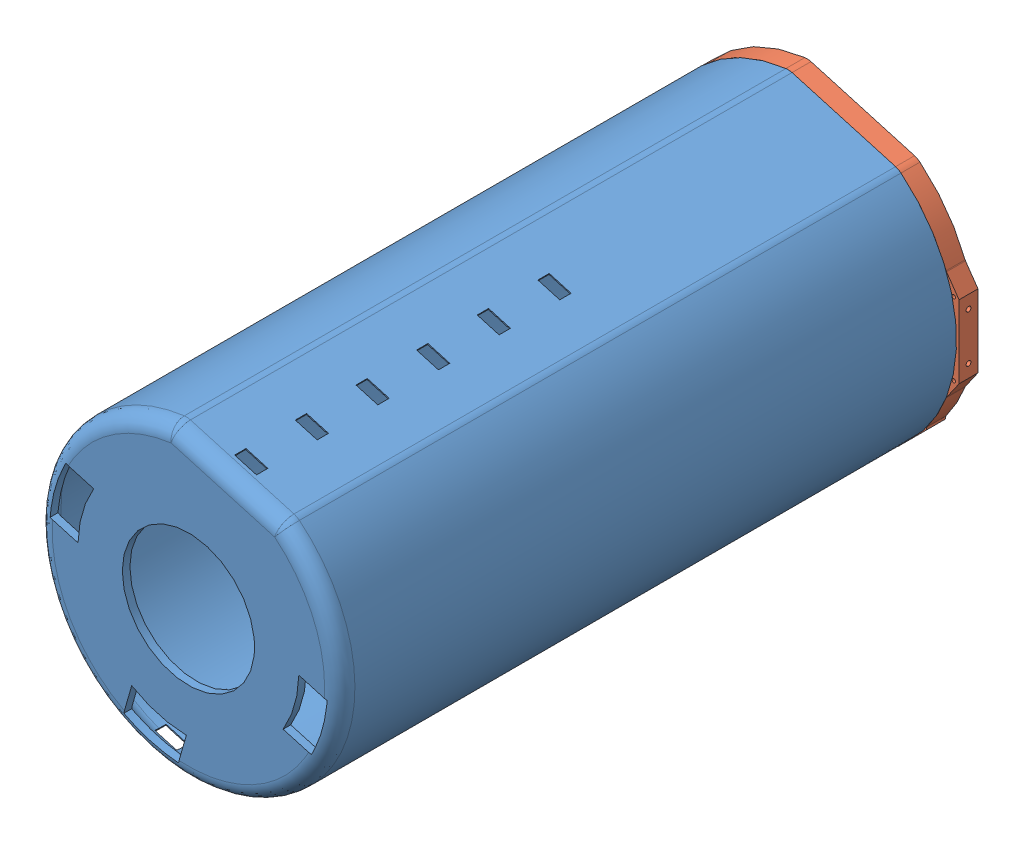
SolidWorks assembly Star_WSC_rev1.SLDASM, configuration Default (file format 4100). Lengths in mm.
Overall size (812 795.69 1677.82).
4 component instances, 4 part files, 10 mates.
Components (placement in the parent):
- Star_WSC_inner_flange-1: Star_WSC_inner_flange.SLDPRT [Default] at origin (suppressed, hidden)
- Star_WSC_cylinder_rev_40-1: Star_WSC_cylinder_rev_40.SLDPRT [Default] at origin size (798.6 795.69 1627.82)
- WSC_large_end_flange-1: WSC_large_end_flange.SLDPRT [Default] at (0 0 -1607.2) x (0 0 -1) z (0 1 0) (suppressed, hidden)
- WSC_large_end_flange_rev1-1: WSC_large_end_flange_rev1.SLDPRT [Default] at (0 0 -1607.2) x (0 0 -1) z (0 1 0) size (80 812 795.69)
Mates (geometry in assembly coordinates):
- Coincident1: coincident aligned: plane of Star_WSC_inner_flange-1 through (0 0 20) normal (0 0 1); plane of Star_WSC_cylinder_rev_40-1 through (0 0 20) normal (0 0 1)
- Coincident2: coincident aligned: plane of ? through (0 0 0) normal (1 0 0)
- Coincident3: coincident aligned: plane of ? through (0 0 0) normal (0 1 0)
- Coincident7: coincident aligned: axis of Star_WSC_cylinder_rev_40-1 through (0 0 -828.85) axis (0 0 -1); axis of WSC_large_end_flange-1 through (0 0 -1607.2) axis (0 0 -1)
- Coincident9: coincident anti-aligned: plane of WSC_large_end_flange-1; plane of assembly
- Coincident10: coincident anti-aligned: plane of Star_WSC_cylinder_rev_40-1 through (0 0 -1607.2) normal (0 0 -1); plane of WSC_large_end_flange-1 through (0 0 -1607.2) normal (0 0 1)
- Coincident11: coincident anti-aligned: plane of Star_WSC_cylinder_rev_40-1 through (0 0 -1607.2) normal (0 0 -1); plane of WSC_large_end_flange_rev1-1 through (-329.81 -242.3878 -1607.2) normal (0 0 1)
- Coincident12: coincident anti-aligned: axis of Star_WSC_cylinder_rev_40-1 through (0 0 20) axis (0 0 -1); axis of WSC_large_end_flange_rev1-1 through (0 0 -1657.2) axis (0 0 1)
- Coincident13: coincident anti-aligned: unknown of WSC_large_end_flange_rev1-1
- PLANE1: unknown = 629.8 mm: plane of ? through (0 0 20) normal (0 0 1)
